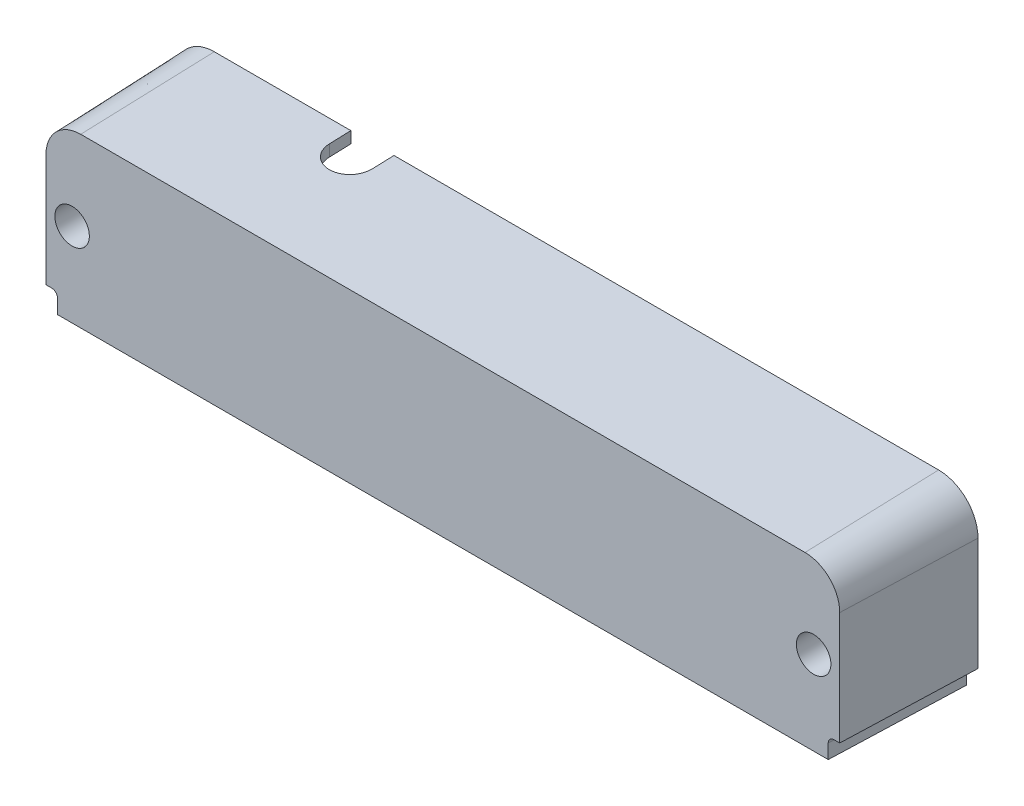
from build123d import *

# Parameters (mm, degrees)
EXTRUDE1_DEPTH           = 23.24
EXTRUDE1_TAPER           = 2
SHELL2_T                 = -2
SKETCH2_W                = 152.126478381
SKETCH2_H                = 0.811558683
EXTRUDE2_DEPTH           = 23.24
CUT_EXTRUDE1_DEPTH       = 152.002035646
EXTRUDE3_DEPTH           = 23.24
EXTRUDE3_DRAFT           = -1
EXTRUDE3_PROFILE_2_DEPTH = 23.24
EXTRUDE3_PROFILE_2_DRAFT = -1
SKETCH7_R                = 3
CUT_EXTRUDE2_DEPTH       = 15
CUT_EXTRUDE8_REACH       = 146.763
CUT_EXTRUDE9_REACH       = 146.763
FILLET3_R                = 2
FILLET4_R                = 2
FILLET5_R                = 2
FILLET6_R                = 2
FILLET7_R                = 2
FILLET8_R                = 2
CUT_EXTRUDE11_DEPTH      = 3.5
CUT_EXTRUDE12_REACH      = 146.763
FILLET9_R                = 1
FILLET10_R               = 1
CUT_EXTRUDE14_REACH      = 146.763


with BuildPart() as part:
    # Sketch1 → Extrude1 (new body)
    with BuildSketch(Plane.XY):
        with BuildLine():
            Line((0, 0), (139.7, 0))
            Line((139.7, 0), (139.7, 23.15))
            ThreePointArc((139.7, 23.15), (137.693681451, 27.993681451), (132.85, 30))
            Line((132.85, 30), (6.85, 30))
            ThreePointArc((6.85, 30), (2.006318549, 27.993681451), (0, 23.15))
            Line((0, 23.15), (0, 0))
        make_face()
    extrude(amount=EXTRUDE1_DEPTH, taper=EXTRUDE1_TAPER)

    # Shell2
    shell2_openings = [part.faces().sort_by_distance(p)[0] for p in [
        (69.85, 14.934959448, 0),
    ]]
    offset(amount=SHELL2_T, openings=shell2_openings, kind=Kind.INTERSECTION)

    # Sketch2 → Extrude2 (add, through all)
    with BuildSketch(Plane.XY.offset(23.24)):
        with Locations((70.25679383, 0.405779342)):
            Rectangle(SKETCH2_W, SKETCH2_H)
    extrude(amount=-EXTRUDE2_DEPTH)

    # Sketch4 → Cut-Extrude1 (cut, through all)
    with BuildSketch(Plane(origin=(0, 0.811558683, 0), x_dir=(-1, 0, 0), z_dir=(0, 1, 0))):
        Polygon((-0.811558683, 23.24), (0, 0), (5.806445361, 0), (5.806445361, 23.24), align=None)
        Polygon((-139.7, 0), (-138.888441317, 23.24), (-146.32003302, 23.24), (-146.32003302, 0), align=None)
    extrude(amount=-CUT_EXTRUDE1_DEPTH, mode=Mode.SUBTRACT)


with BuildPart() as extrude3_tool:
    # Sketch5 → Extrude3 (with draft: the straight prism first)
    with BuildSketch(Plane.XY.offset(23.24)):
        with BuildLine():
            Line((0.811558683, 18.593441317), (0.811558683, 10.593441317))
            Line((0.811558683, 10.593441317), (5.351558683, 10.593441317))
            ThreePointArc((5.351558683, 10.593441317), (9.351558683, 14.593441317), (5.351558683, 18.593441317))
            Line((5.351558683, 18.593441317), (0.811558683, 18.593441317))
        make_face()
    extrude(amount=-EXTRUDE3_DEPTH)
    # Extrude3: the draft: its side faces are tilted about the plane it starts from
    extrude3_sides = [extrude3_tool.faces().sort_by_distance(p)[0] for p in [
        (3.081558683, 18.593441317, 11.62),
        (0.811558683, 14.593441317, 11.62),
        (3.081558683, 10.593441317, 11.62),
        (9.351558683, 14.593441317, 11.62),
    ]]
    draft(extrude3_sides, Plane.XY.offset(23.24), EXTRUDE3_DRAFT)


with BuildPart() as part_1:
    add(part.part)

    # Extrude3: add extrude3_tool
    add(extrude3_tool.part)


with BuildPart() as extrude3_profile_2_tool:
    # Sketch5 → Extrude3 profile 2 (with draft: the straight prism first)
    with BuildSketch(Plane.XY.offset(23.24)):
        with BuildLine():
            Line((138.888441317, 18.593441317), (134.348441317, 18.593441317))
            ThreePointArc((134.348441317, 18.593441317), (130.348441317, 14.593441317), (134.348441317, 10.593441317))
            Line((134.348441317, 10.593441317), (138.888441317, 10.593441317))
            Line((138.888441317, 10.593441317), (138.888441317, 18.593441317))
        make_face()
    extrude(amount=-EXTRUDE3_PROFILE_2_DEPTH)
    # Extrude3 profile 2: the draft: its side faces are tilted about the plane it starts from
    extrude3_profile_2_sides = [extrude3_profile_2_tool.faces().sort_by_distance(p)[0] for p in [
        (136.618441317, 18.593441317, 11.62),
        (130.348441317, 14.593441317, 11.62),
        (136.618441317, 10.593441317, 11.62),
        (138.888441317, 14.593441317, 11.62),
    ]]
    draft(extrude3_profile_2_sides, Plane.XY.offset(23.24), EXTRUDE3_PROFILE_2_DRAFT)


with BuildPart() as part_2:
    add(part_1.part)

    # Extrude3 profile 2: add extrude3_profile_2_tool
    add(extrude3_profile_2_tool.part)

    # Sketch7 → Cut-Extrude2 (cut)
    with BuildSketch(Plane.XY.offset(23.24)):
        with Locations((134.348441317, 14.593441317)):
            Circle(SKETCH7_R)
        with Locations((5.351558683, 14.593441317)):
            Circle(SKETCH7_R)
    extrude(amount=-CUT_EXTRUDE2_DEPTH, mode=Mode.SUBTRACT)

    # Cut-Extrude4 cone 1 section (on through the dimple's axis) → Cut-Extrude4 (revolve, cut)
    with BuildSketch(Plane(origin=(5.351558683, 14.593441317, 23.24), x_dir=(0, -1, 0), z_dir=(1, 0, 0))):
        Polygon((0, 0), (1.75, 0), (0, 100.257432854), align=None)
    revolve(axis=Axis((5.351558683, 14.593441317, 23.24), (0, 0, -1)), mode=Mode.SUBTRACT)

    # Cut-Extrude4 cone 2 section (on through the dimple's axis) → Cut-Extrude4 cone 2 (revolve, cut)
    with BuildSketch(Plane(origin=(134.348441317, 14.593441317, 23.24), x_dir=(0, -1, 0), z_dir=(1, 0, 0))):
        Polygon((0, 0), (1.75, 0), (0, 100.257432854), align=None)
    revolve(axis=Axis((134.348441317, 14.593441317, 23.24), (0, 0, -1)), mode=Mode.SUBTRACT)

    # Cut-Extrude8: up to this plane
    cut_extrude8_end = Plane(origin=(6.85, 28.001218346, -0.069798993), z_dir=(0, 0.9993908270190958, 0.034899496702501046))
    # Sketch13 → Cut-Extrude8 (cut, up to the surface)
    with BuildSketch(Plane.XZ.offset(-30), mode=Mode.PRIVATE) as cut_extrude8_sk1:
        with BuildLine():
            Line((30.602392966, 3.747715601), (30.602392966, 0))
            Line((30.602392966, 0), (38.102392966, 0))
            Line((38.102392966, 0), (38.102392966, 3.747715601))
            add(Edge.make_bspline(
                [(38.102392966, 3.747715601), (38.102392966, 7.495431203), (34.352392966, 7.495431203), (30.602392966, 7.495431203), (30.602392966, 3.747715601)],
                knots=[0, 0, 0, 1.570796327, 1.570796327, 3.141592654, 3.141592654, 3.141592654], degree=2, weights=[1, 0.707106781, 1, 0.707106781, 1]))
        make_face()
    cut_extrude8_tool1 = split(extrude(cut_extrude8_sk1.sketch, amount=CUT_EXTRUDE8_REACH, mode=Mode.PRIVATE), bisect_by=cut_extrude8_end, keep=Keep.BOTH, mode=Mode.PRIVATE)
    add(cut_extrude8_tool1.solids().sort_by_distance((34.352393, 30, 3.397611))[0], mode=Mode.SUBTRACT)

    # Sketch14 → Cut-Extrude9 (cut, up to next)
    with BuildSketch(Plane.ZY, mode=Mode.PRIVATE) as cut_extrude9_sk1:
        with BuildLine():
            Line((0, 9.999097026), (5, 9.999097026))
            ThreePointArc((5, 9.999097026), (5.707106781, 9.706203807), (6, 8.999097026))
            Line((6, 8.999097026), (6, 5.999097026))
            ThreePointArc((6, 5.999097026), (5.707106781, 5.291990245), (5, 4.999097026))
            Line((5, 4.999097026), (0, 4.999097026))
            Line((0, 4.999097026), (0, 9.999097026))
        make_face()
    cut_extrude9_tool1 = extrude(cut_extrude9_sk1.sketch, amount=-CUT_EXTRUDE9_REACH, mode=Mode.PRIVATE) & part_2.part
    # Sketch14 → Cut-Extrude9 (cut, up to next)
    with BuildSketch(Plane.ZY, mode=Mode.PRIVATE) as cut_extrude9_sk2:
        with BuildLine():
            Line((0, 18.999097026), (5, 18.999097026))
            ThreePointArc((5, 18.999097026), (5.707106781, 19.291990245), (6, 19.999097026))
            Line((6, 19.999097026), (6, 22.999097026))
            ThreePointArc((6, 22.999097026), (5.707106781, 23.706203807), (5, 23.999097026))
            Line((5, 23.999097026), (0, 23.999097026))
            Line((0, 23.999097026), (0, 18.999097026))
        make_face()
    cut_extrude9_tool2 = extrude(cut_extrude9_sk2.sketch, amount=-CUT_EXTRUDE9_REACH, mode=Mode.PRIVATE) & part_2.part
    add(cut_extrude9_tool1.solids().sort_by_distance((0, 7.499097, 2.959699))[0], mode=Mode.SUBTRACT)
    add(cut_extrude9_tool2.solids().sort_by_distance((0, 21.499097, 2.959699))[0], mode=Mode.SUBTRACT)

    # Fillet3
    fillet3_edges = [part_2.edges().sort_by_distance(p)[0] for p in [
        (2.372077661, 18.373158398, 10.62),
    ]]
    fillet(fillet3_edges, radius=FILLET3_R)

    # Fillet4
    fillet4_edges = [part_2.edges().sort_by_distance(p)[0] for p in [
        (2.372077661, 10.813724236, 10.62),
    ]]
    fillet(fillet4_edges, radius=FILLET4_R)

    # Fillet5
    fillet5_edges = [part_2.edges().sort_by_distance(p)[0] for p in [
        (2.372077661, 2.372077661, 10.62),
    ]]
    fillet(fillet5_edges, radius=FILLET5_R)

    # Fillet6
    fillet6_edges = [part_2.edges().sort_by_distance(p)[0] for p in [
        (137.327922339, 10.813724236, 10.62),
    ]]
    fillet(fillet6_edges, radius=FILLET6_R)

    # Fillet7
    fillet7_edges = [part_2.edges().sort_by_distance(p)[0] for p in [
        (137.327922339, 18.373158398, 10.62),
    ]]
    fillet(fillet7_edges, radius=FILLET7_R)

    # Fillet8
    fillet8_edges = [part_2.edges().sort_by_distance(p)[0] for p in [
        (137.327922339, 2.372077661, 10.62),
    ]]
    fillet(fillet8_edges, radius=FILLET8_R)

    # Sketch16 → Cut-Extrude11 (cut)
    with BuildSketch(Plane.XZ):
        Polygon((139.7, 0), (138.888441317, 23.24), (136.887222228, 23.24), (137.701218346, -0.069798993), align=None)
        Polygon((0, 0), (0.811558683, 23.24), (1.052980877, 23.24), (2.812777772, 23.24), (1.998781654, -0.069798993), align=None)
    extrude(amount=-CUT_EXTRUDE11_DEPTH, mode=Mode.SUBTRACT)

    # Cut-Extrude12: up to this plane
    cut_extrude12_end = Plane(origin=(0, 1.998781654, -0.069798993), z_dir=(0, -0.9993908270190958, 0.034899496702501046))
    # Sketch17 → Cut-Extrude12 (cut, up to the surface)
    with BuildSketch(Plane.XZ, mode=Mode.PRIVATE) as cut_extrude12_sk1:
        Polygon((122.96, 14.06), (122.96, 11.06), (122.96, 0), (127.621730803, 0), (127.621730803, 11.06), (127.621730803, 14.06), align=None)
    cut_extrude12_tool1 = split(extrude(cut_extrude12_sk1.sketch, amount=-CUT_EXTRUDE12_REACH, mode=Mode.PRIVATE), bisect_by=cut_extrude12_end, keep=Keep.BOTH, mode=Mode.PRIVATE)
    add(cut_extrude12_tool1.solids().sort_by_distance((125.290865, 0, 7.03))[0], mode=Mode.SUBTRACT)
    # Sketch17 → Cut-Extrude12 (cut, up to the surface)
    with BuildSketch(Plane.XZ, mode=Mode.PRIVATE) as cut_extrude12_sk2:
        Polygon((18.51398911, 13.74), (18.51398911, 11.06), (18.51398911, 0), (23.51398911, 0), (23.51398911, 11.06), (23.51398911, 13.74), align=None)
    cut_extrude12_tool2 = split(extrude(cut_extrude12_sk2.sketch, amount=-CUT_EXTRUDE12_REACH, mode=Mode.PRIVATE), bisect_by=cut_extrude12_end, keep=Keep.BOTH, mode=Mode.PRIVATE)
    add(cut_extrude12_tool2.solids().sort_by_distance((21.013989, 0, 6.87))[0], mode=Mode.SUBTRACT)

    # Fillet9
    fillet9_edges = [part_2.edges().sort_by_distance(p)[0] for p in [
        (137.29300157, 3.5, 11.62),
    ]]
    fillet(fillet9_edges, radius=FILLET9_R)

    # Fillet10
    fillet10_edges = [part_2.edges().sort_by_distance(p)[0] for p in [
        (2.40699843, 3.5, 11.62),
    ]]
    fillet(fillet10_edges, radius=FILLET10_R)

    # Cut-Extrude14: up to this plane
    cut_extrude14_end = Plane(origin=(0, 1.998781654, -0.069798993), z_dir=(0, -0.9993908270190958, 0.034899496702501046))
    # Sketch20 → Cut-Extrude14 (cut, up to the surface)
    with BuildSketch(Plane.XZ, mode=Mode.PRIVATE) as cut_extrude14_sk1:
        Polygon((83.8, 0), (79.4, 0), (79.4, 3.832986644), (79.4, 13.74), (83.8, 13.74), (83.8, 3.832986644), align=None)
    cut_extrude14_tool1 = split(extrude(cut_extrude14_sk1.sketch, amount=-CUT_EXTRUDE14_REACH, mode=Mode.PRIVATE), bisect_by=cut_extrude14_end, keep=Keep.BOTH, mode=Mode.PRIVATE)
    add(cut_extrude14_tool1.solids().sort_by_distance((81.6, 0, 6.87))[0], mode=Mode.SUBTRACT)


solid = part_2.part
